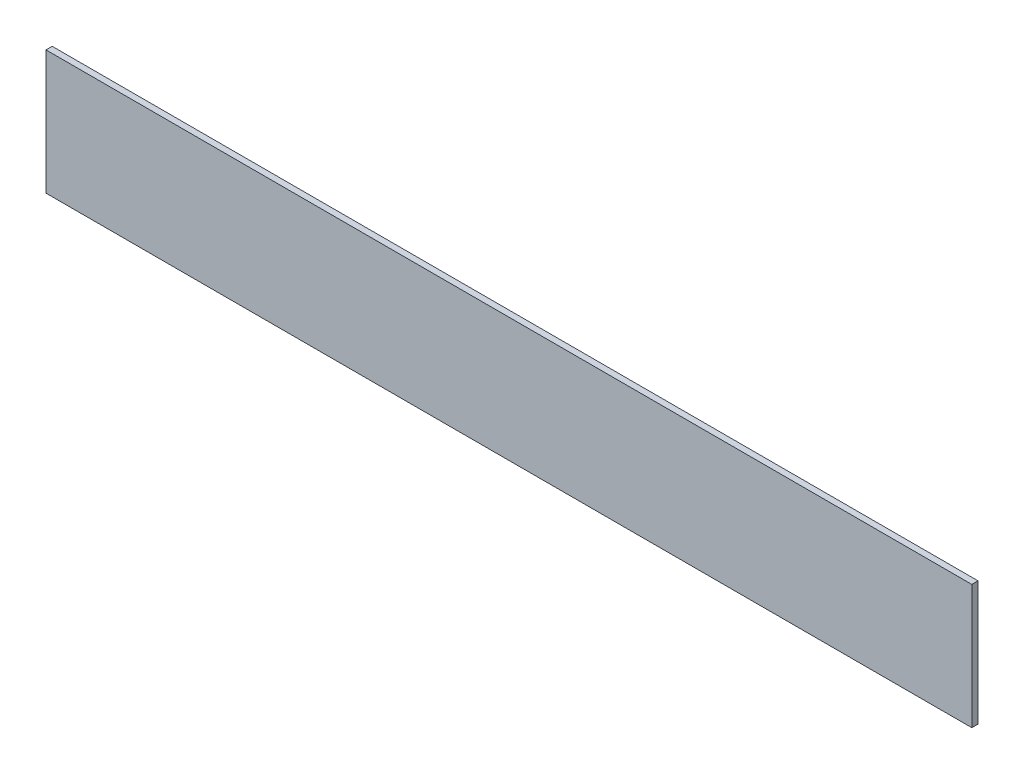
ISO-10303-21;
HEADER;
FILE_DESCRIPTION(('STEP AP214'),'2;1');
FILE_NAME('part.step','',(''),(''),'','','');
FILE_SCHEMA(('AUTOMOTIVE_DESIGN { 1 0 10303 214 1 1 1 1 }'));
ENDSEC;
DATA;
#1=APPLICATION_CONTEXT('core data for automotive mechanical design processes');
#2=APPLICATION_PROTOCOL_DEFINITION('international standard','automotive_design',2000,#1);
#3=PRODUCT_CONTEXT('',#1,'mechanical');
#4=PRODUCT('Part','Part','',(#3));
#5=PRODUCT_RELATED_PRODUCT_CATEGORY('part','',(#4));
#6=PRODUCT_DEFINITION_FORMATION('','',#4);
#7=PRODUCT_DEFINITION_CONTEXT('part definition',#1,'design');
#8=PRODUCT_DEFINITION('design','',#6,#7);
#9=PRODUCT_DEFINITION_SHAPE('','',#8);
#10=(LENGTH_UNIT() NAMED_UNIT(*) SI_UNIT(.MILLI.,.METRE.));
#11=(NAMED_UNIT(*) PLANE_ANGLE_UNIT() SI_UNIT($,.RADIAN.));
#12=(NAMED_UNIT(*) SI_UNIT($,.STERADIAN.) SOLID_ANGLE_UNIT());
#13=UNCERTAINTY_MEASURE_WITH_UNIT(LENGTH_MEASURE(1.E-05),#10,'distance_accuracy_value','');
#14=(GEOMETRIC_REPRESENTATION_CONTEXT(3) GLOBAL_UNCERTAINTY_ASSIGNED_CONTEXT((#13)) GLOBAL_UNIT_ASSIGNED_CONTEXT((#10,
#11,#12)) REPRESENTATION_CONTEXT('',''));
#15=CARTESIAN_POINT('',(0.,0.,0.));
#16=DIRECTION('',(0.,0.,1.));
#17=DIRECTION('',(1.,0.,0.));
#18=AXIS2_PLACEMENT_3D('',#15,#16,#17);
#19=CARTESIAN_POINT('',(400.,50.,0.));
#20=DIRECTION('',(0.,-1.,0.));
#21=DIRECTION('',(0.,0.,-1.));
#22=AXIS2_PLACEMENT_3D('',#19,#20,#21);
#23=PLANE('',#22);
#24=DIRECTION('',(0.,0.,-1.));
#25=VECTOR('',#24,1.);
#26=CARTESIAN_POINT('',(-373.,50.,12.5));
#27=LINE('',#26,#25);
#28=CARTESIAN_POINT('',(-373.,50.,5.));
#29=VERTEX_POINT('',#28);
#30=CARTESIAN_POINT('',(-373.,50.,0.));
#31=VERTEX_POINT('',#30);
#32=EDGE_CURVE('E10',#29,#31,#27,.T.);
#33=ORIENTED_EDGE('',*,*,#32,.F.);
#34=DIRECTION('',(-1.,0.,0.));
#35=VECTOR('',#34,1.);
#36=CARTESIAN_POINT('',(400.,50.,5.));
#37=LINE('',#36,#35);
#38=CARTESIAN_POINT('',(373.,50.,5.));
#39=VERTEX_POINT('',#38);
#40=EDGE_CURVE('E42',#39,#29,#37,.T.);
#41=ORIENTED_EDGE('',*,*,#40,.F.);
#42=DIRECTION('',(0.,0.,1.));
#43=VECTOR('',#42,1.);
#44=CARTESIAN_POINT('',(373.,50.,-12.5));
#45=LINE('',#44,#43);
#46=CARTESIAN_POINT('',(373.,50.,0.));
#47=VERTEX_POINT('',#46);
#48=EDGE_CURVE('E75',#47,#39,#45,.T.);
#49=ORIENTED_EDGE('',*,*,#48,.F.);
#50=DIRECTION('',(-1.,0.,0.));
#51=VECTOR('',#50,1.);
#52=CARTESIAN_POINT('',(400.,50.,0.));
#53=LINE('',#52,#51);
#54=EDGE_CURVE('E78',#47,#31,#53,.T.);
#55=ORIENTED_EDGE('',*,*,#54,.T.);
#56=EDGE_LOOP('',(#33,#41,#49,#55));
#57=FACE_BOUND('',#56,.T.);
#58=ADVANCED_FACE('F16',(#57),#23,.F.);
#59=CARTESIAN_POINT('',(-373.,-60.,25.));
#60=DIRECTION('',(-1.,0.,0.));
#61=DIRECTION('',(0.,0.,1.));
#62=AXIS2_PLACEMENT_3D('',#59,#60,#61);
#63=PLANE('',#62);
#64=DIRECTION('',(0.,-1.,0.));
#65=VECTOR('',#64,1.);
#66=CARTESIAN_POINT('',(-373.,-30.,0.));
#67=LINE('',#66,#65);
#68=CARTESIAN_POINT('',(-373.,-50.,0.));
#69=VERTEX_POINT('',#68);
#70=EDGE_CURVE('E104',#31,#69,#67,.T.);
#71=ORIENTED_EDGE('',*,*,#70,.T.);
#72=DIRECTION('',(0.,0.,1.));
#73=VECTOR('',#72,1.);
#74=CARTESIAN_POINT('',(-373.,-50.,12.5));
#75=LINE('',#74,#73);
#76=CARTESIAN_POINT('',(-373.,-50.,5.));
#77=VERTEX_POINT('',#76);
#78=EDGE_CURVE('E87',#69,#77,#75,.T.);
#79=ORIENTED_EDGE('',*,*,#78,.T.);
#80=DIRECTION('',(0.,-1.,0.));
#81=VECTOR('',#80,1.);
#82=CARTESIAN_POINT('',(-373.,-30.,5.));
#83=LINE('',#82,#81);
#84=EDGE_CURVE('E19',#29,#77,#83,.T.);
#85=ORIENTED_EDGE('',*,*,#84,.F.);
#86=ORIENTED_EDGE('',*,*,#32,.T.);
#87=EDGE_LOOP('',(#71,#79,#85,#86));
#88=FACE_BOUND('',#87,.T.);
#89=ADVANCED_FACE('F127',(#88),#63,.T.);
#90=CARTESIAN_POINT('',(0.,0.,5.));
#91=DIRECTION('',(0.,0.,1.));
#92=DIRECTION('',(1.,0.,0.));
#93=AXIS2_PLACEMENT_3D('',#90,#91,#92);
#94=PLANE('',#93);
#95=ORIENTED_EDGE('',*,*,#40,.T.);
#96=ORIENTED_EDGE('',*,*,#84,.T.);
#97=DIRECTION('',(1.,0.,0.));
#98=VECTOR('',#97,1.);
#99=CARTESIAN_POINT('',(-400.,-50.,5.));
#100=LINE('',#99,#98);
#101=CARTESIAN_POINT('',(373.,-50.,5.));
#102=VERTEX_POINT('',#101);
#103=EDGE_CURVE('E81',#77,#102,#100,.T.);
#104=ORIENTED_EDGE('',*,*,#103,.T.);
#105=DIRECTION('',(0.,1.,0.));
#106=VECTOR('',#105,1.);
#107=CARTESIAN_POINT('',(373.,-30.,5.));
#108=LINE('',#107,#106);
#109=EDGE_CURVE('E69',#102,#39,#108,.T.);
#110=ORIENTED_EDGE('',*,*,#109,.T.);
#111=EDGE_LOOP('',(#95,#96,#104,#110));
#112=FACE_BOUND('',#111,.T.);
#113=ADVANCED_FACE('F82',(#112),#94,.T.);
#114=CARTESIAN_POINT('',(373.,-60.,-25.));
#115=DIRECTION('',(1.,0.,0.));
#116=DIRECTION('',(0.,1.,0.));
#117=AXIS2_PLACEMENT_3D('',#114,#115,#116);
#118=PLANE('',#117);
#119=ORIENTED_EDGE('',*,*,#109,.F.);
#120=DIRECTION('',(0.,0.,-1.));
#121=VECTOR('',#120,1.);
#122=CARTESIAN_POINT('',(373.,-50.,-12.5));
#123=LINE('',#122,#121);
#124=CARTESIAN_POINT('',(373.,-50.,0.));
#125=VERTEX_POINT('',#124);
#126=EDGE_CURVE('E74',#102,#125,#123,.T.);
#127=ORIENTED_EDGE('',*,*,#126,.T.);
#128=DIRECTION('',(0.,1.,0.));
#129=VECTOR('',#128,1.);
#130=CARTESIAN_POINT('',(373.,-30.,0.));
#131=LINE('',#130,#129);
#132=EDGE_CURVE('E101',#125,#47,#131,.T.);
#133=ORIENTED_EDGE('',*,*,#132,.T.);
#134=ORIENTED_EDGE('',*,*,#48,.T.);
#135=EDGE_LOOP('',(#119,#127,#133,#134));
#136=FACE_BOUND('',#135,.T.);
#137=ADVANCED_FACE('F71',(#136),#118,.T.);
#138=CARTESIAN_POINT('',(0.,0.,0.));
#139=DIRECTION('',(0.,0.,1.));
#140=DIRECTION('',(1.,0.,0.));
#141=AXIS2_PLACEMENT_3D('',#138,#139,#140);
#142=PLANE('',#141);
#143=ORIENTED_EDGE('',*,*,#132,.F.);
#144=DIRECTION('',(1.,0.,0.));
#145=VECTOR('',#144,1.);
#146=CARTESIAN_POINT('',(-400.,-50.,0.));
#147=LINE('',#146,#145);
#148=EDGE_CURVE('E92',#69,#125,#147,.T.);
#149=ORIENTED_EDGE('',*,*,#148,.F.);
#150=ORIENTED_EDGE('',*,*,#70,.F.);
#151=ORIENTED_EDGE('',*,*,#54,.F.);
#152=EDGE_LOOP('',(#143,#149,#150,#151));
#153=FACE_BOUND('',#152,.T.);
#154=ADVANCED_FACE('F121',(#153),#142,.F.);
#155=CARTESIAN_POINT('',(-400.,-50.,0.));
#156=DIRECTION('',(0.,1.,0.));
#157=DIRECTION('',(1.,0.,0.));
#158=AXIS2_PLACEMENT_3D('',#155,#156,#157);
#159=PLANE('',#158);
#160=ORIENTED_EDGE('',*,*,#126,.F.);
#161=ORIENTED_EDGE('',*,*,#103,.F.);
#162=ORIENTED_EDGE('',*,*,#78,.F.);
#163=ORIENTED_EDGE('',*,*,#148,.T.);
#164=EDGE_LOOP('',(#160,#161,#162,#163));
#165=FACE_BOUND('',#164,.T.);
#166=ADVANCED_FACE('F90',(#165),#159,.F.);
#167=CLOSED_SHELL('',(#58,#89,#113,#137,#154,#166));
#168=MANIFOLD_SOLID_BREP('B1',#167);
#169=ADVANCED_BREP_SHAPE_REPRESENTATION('',(#18,#168),#14);
#170=SHAPE_DEFINITION_REPRESENTATION(#9,#169);
ENDSEC;
END-ISO-10303-21;
